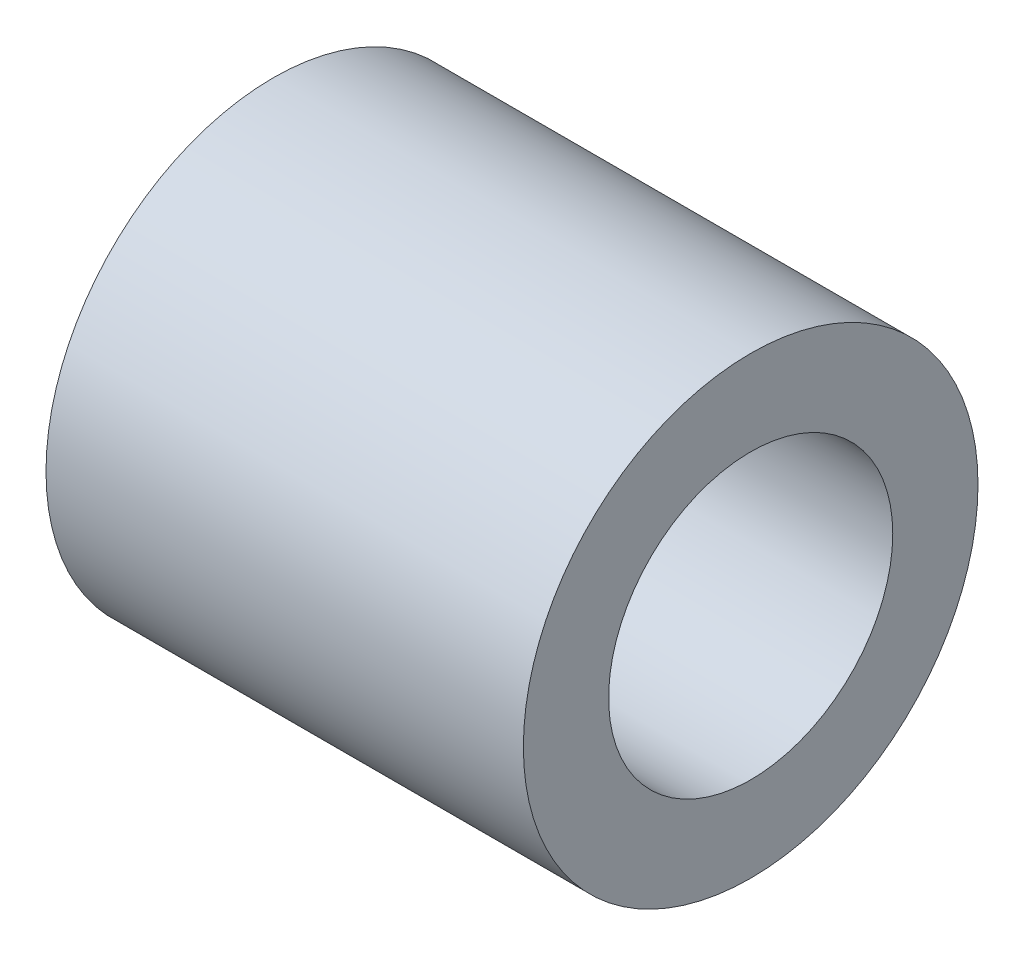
from build123d import *

# Parameters (mm, degrees)
ESBO_O1_R                         = 2
RESSALTO_EXTRUS_O1_DEPTH          = 4.1
RESSALTO_EXTRUS_O2_START          = -0.1
ESBO_O2_R                         = 2
RESSALTO_EXTRUS_O2_DEPTH          = 0.1
CORTE_EXTRUS_O1_REACH             = 6.981
ESBO_O4_R                         = 1.25
CORTE_EXTRUS_O1_DIRECTION_2_REACH = 6.981


with BuildPart() as part:
    # Esbo_o1 → Ressalto-extrus_o1 (new body)
    with BuildSketch(Plane(origin=(0, 0, 0), x_dir=(0, 0, -1), z_dir=(1, 0, 0))):
        Circle(ESBO_O1_R)
    extrude(amount=RESSALTO_EXTRUS_O1_DEPTH)

    # Esbo_o2 → Ressalto-extrus_o2 (add)
    with BuildSketch(Plane(origin=(0, 0, 0), x_dir=(0, 0, -1), z_dir=(1, 0, 0)).offset(RESSALTO_EXTRUS_O2_START)):
        Circle(ESBO_O2_R)
    extrude(amount=RESSALTO_EXTRUS_O2_DEPTH)

    # Esbo_o4 → Corte-extrus_o1 (cut, up to next)
    with BuildSketch(Plane(origin=(0, 0, 0), x_dir=(0, 0, -1), z_dir=(1, 0, 0)), mode=Mode.PRIVATE) as corte_extrus_o1_sk1:
        Circle(ESBO_O4_R)
    corte_extrus_o1_tool1 = extrude(corte_extrus_o1_sk1.sketch, amount=-CORTE_EXTRUS_O1_REACH, mode=Mode.PRIVATE) & part.part
    add(corte_extrus_o1_tool1.solids().sort_by_distance((0, 0, 0))[0], mode=Mode.SUBTRACT)

    # Esbo_o4 → Corte-extrus_o1 direction 2 (cut, up to next)
    with BuildSketch(Plane(origin=(0, 0, 0), x_dir=(0, 0, -1), z_dir=(1, 0, 0)), mode=Mode.PRIVATE) as corte_extrus_o1_direction_2_sk1:
        Circle(ESBO_O4_R)
    corte_extrus_o1_direction_2_tool1 = extrude(corte_extrus_o1_direction_2_sk1.sketch, amount=CORTE_EXTRUS_O1_DIRECTION_2_REACH, mode=Mode.PRIVATE) & part.part
    add(corte_extrus_o1_direction_2_tool1.solids().sort_by_distance((0, 0, 0))[0], mode=Mode.SUBTRACT)


solid = part.part
